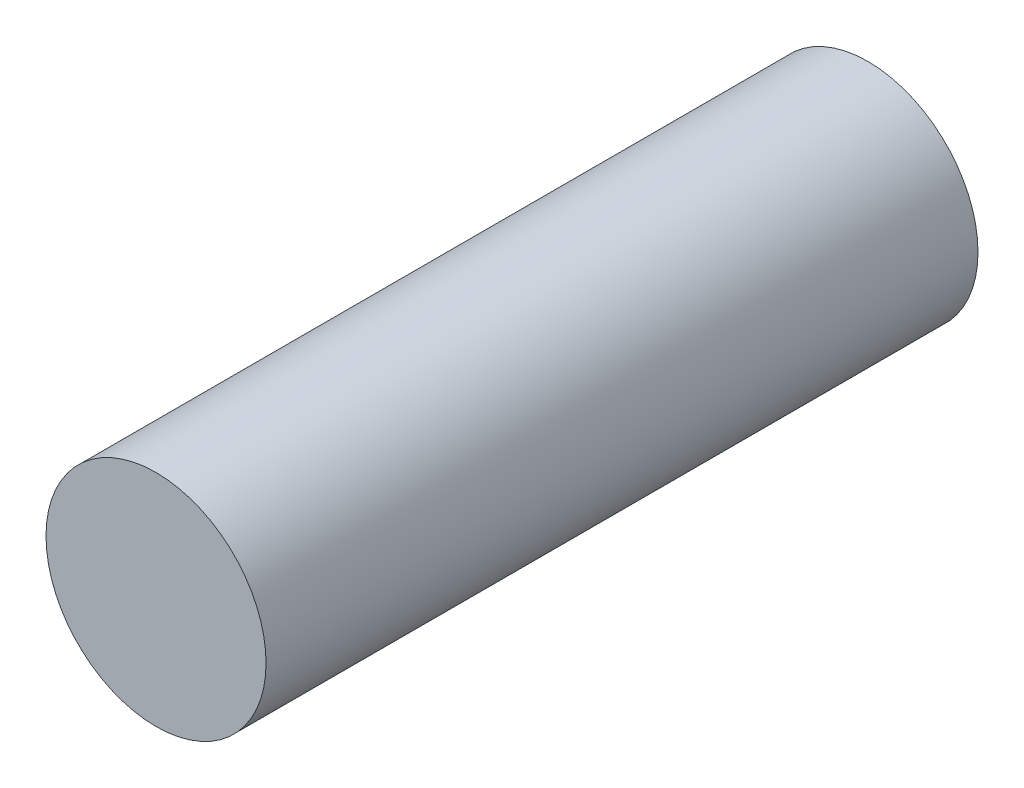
ISO-10303-21;
HEADER;
FILE_DESCRIPTION(('STEP AP214'),'2;1');
FILE_NAME('part.step','',(''),(''),'','','');
FILE_SCHEMA(('AUTOMOTIVE_DESIGN { 1 0 10303 214 1 1 1 1 }'));
ENDSEC;
DATA;
#1=APPLICATION_CONTEXT('core data for automotive mechanical design processes');
#2=APPLICATION_PROTOCOL_DEFINITION('international standard','automotive_design',2000,#1);
#3=PRODUCT_CONTEXT('',#1,'mechanical');
#4=PRODUCT('Part','Part','',(#3));
#5=PRODUCT_RELATED_PRODUCT_CATEGORY('part','',(#4));
#6=PRODUCT_DEFINITION_FORMATION('','',#4);
#7=PRODUCT_DEFINITION_CONTEXT('part definition',#1,'design');
#8=PRODUCT_DEFINITION('design','',#6,#7);
#9=PRODUCT_DEFINITION_SHAPE('','',#8);
#10=(LENGTH_UNIT() NAMED_UNIT(*) SI_UNIT(.MILLI.,.METRE.));
#11=(NAMED_UNIT(*) PLANE_ANGLE_UNIT() SI_UNIT($,.RADIAN.));
#12=(NAMED_UNIT(*) SI_UNIT($,.STERADIAN.) SOLID_ANGLE_UNIT());
#13=UNCERTAINTY_MEASURE_WITH_UNIT(LENGTH_MEASURE(1.E-05),#10,'distance_accuracy_value','');
#14=(GEOMETRIC_REPRESENTATION_CONTEXT(3) GLOBAL_UNCERTAINTY_ASSIGNED_CONTEXT((#13)) GLOBAL_UNIT_ASSIGNED_CONTEXT((#10,
#11,#12)) REPRESENTATION_CONTEXT('',''));
#15=CARTESIAN_POINT('',(0.,0.,0.));
#16=DIRECTION('',(0.,0.,1.));
#17=DIRECTION('',(1.,0.,0.));
#18=AXIS2_PLACEMENT_3D('',#15,#16,#17);
#19=CARTESIAN_POINT('',(0.,0.,4.191));
#20=DIRECTION('',(0.,0.,-1.));
#21=DIRECTION('',(-1.,0.,0.));
#22=AXIS2_PLACEMENT_3D('',#19,#20,#21);
#23=CYLINDRICAL_SURFACE('',#22,0.6477);
#24=CARTESIAN_POINT('',(0.,0.,4.191));
#25=DIRECTION('',(0.,0.,1.));
#26=DIRECTION('',(1.,0.,0.));
#27=AXIS2_PLACEMENT_3D('',#24,#25,#26);
#28=CIRCLE('',#27,0.6477);
#29=CARTESIAN_POINT('',(0.6477,0.,4.191));
#30=VERTEX_POINT('',#29);
#31=EDGE_CURVE('E10',#30,#30,#28,.T.);
#32=ORIENTED_EDGE('',*,*,#31,.F.);
#33=EDGE_LOOP('',(#32));
#34=FACE_BOUND('',#33,.T.);
#35=CARTESIAN_POINT('',(0.,0.,0.));
#36=DIRECTION('',(0.,0.,1.));
#37=DIRECTION('',(1.,0.,0.));
#38=AXIS2_PLACEMENT_3D('',#35,#36,#37);
#39=CIRCLE('',#38,0.6477);
#40=CARTESIAN_POINT('',(0.6477,0.,0.));
#41=VERTEX_POINT('',#40);
#42=EDGE_CURVE('E33',#41,#41,#39,.T.);
#43=ORIENTED_EDGE('',*,*,#42,.T.);
#44=EDGE_LOOP('',(#43));
#45=FACE_BOUND('',#44,.T.);
#46=ADVANCED_FACE('F30',(#34,#45),#23,.T.);
#47=CARTESIAN_POINT('',(0.,0.,4.191));
#48=DIRECTION('',(0.,0.,1.));
#49=DIRECTION('',(1.,0.,0.));
#50=AXIS2_PLACEMENT_3D('',#47,#48,#49);
#51=PLANE('',#50);
#52=ORIENTED_EDGE('',*,*,#31,.T.);
#53=EDGE_LOOP('',(#52));
#54=FACE_BOUND('',#53,.T.);
#55=ADVANCED_FACE('F45',(#54),#51,.T.);
#56=CARTESIAN_POINT('',(0.,0.,0.));
#57=DIRECTION('',(0.,0.,1.));
#58=DIRECTION('',(1.,0.,0.));
#59=AXIS2_PLACEMENT_3D('',#56,#57,#58);
#60=PLANE('',#59);
#61=ORIENTED_EDGE('',*,*,#42,.F.);
#62=EDGE_LOOP('',(#61));
#63=FACE_BOUND('',#62,.T.);
#64=ADVANCED_FACE('F43',(#63),#60,.F.);
#65=CLOSED_SHELL('',(#46,#55,#64));
#66=MANIFOLD_SOLID_BREP('B2',#65);
#67=ADVANCED_BREP_SHAPE_REPRESENTATION('',(#18,#66),#14);
#68=SHAPE_DEFINITION_REPRESENTATION(#9,#67);
ENDSEC;
END-ISO-10303-21;
